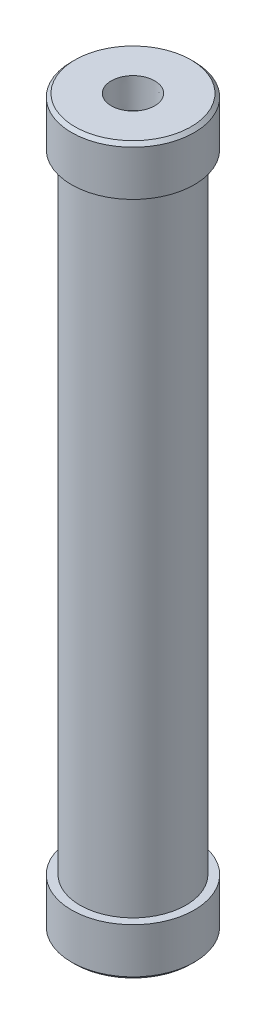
ISO-10303-21;
HEADER;
FILE_DESCRIPTION(('STEP AP214'),'2;1');
FILE_NAME('part.step','',(''),(''),'','','');
FILE_SCHEMA(('AUTOMOTIVE_DESIGN { 1 0 10303 214 1 1 1 1 }'));
ENDSEC;
DATA;
#1=APPLICATION_CONTEXT('core data for automotive mechanical design processes');
#2=APPLICATION_PROTOCOL_DEFINITION('international standard','automotive_design',2000,#1);
#3=PRODUCT_CONTEXT('',#1,'mechanical');
#4=PRODUCT('Part','Part','',(#3));
#5=PRODUCT_RELATED_PRODUCT_CATEGORY('part','',(#4));
#6=PRODUCT_DEFINITION_FORMATION('','',#4);
#7=PRODUCT_DEFINITION_CONTEXT('part definition',#1,'design');
#8=PRODUCT_DEFINITION('design','',#6,#7);
#9=PRODUCT_DEFINITION_SHAPE('','',#8);
#10=(LENGTH_UNIT() NAMED_UNIT(*) SI_UNIT(.MILLI.,.METRE.));
#11=(NAMED_UNIT(*) PLANE_ANGLE_UNIT() SI_UNIT($,.RADIAN.));
#12=(NAMED_UNIT(*) SI_UNIT($,.STERADIAN.) SOLID_ANGLE_UNIT());
#13=UNCERTAINTY_MEASURE_WITH_UNIT(LENGTH_MEASURE(1.E-05),#10,'distance_accuracy_value','');
#14=(GEOMETRIC_REPRESENTATION_CONTEXT(3) GLOBAL_UNCERTAINTY_ASSIGNED_CONTEXT((#13)) GLOBAL_UNIT_ASSIGNED_CONTEXT((#10,
#11,#12)) REPRESENTATION_CONTEXT('',''));
#15=CARTESIAN_POINT('',(0.,0.,0.));
#16=DIRECTION('',(0.,0.,1.));
#17=DIRECTION('',(1.,0.,0.));
#18=AXIS2_PLACEMENT_3D('',#15,#16,#17);
#19=CARTESIAN_POINT('',(0.,22.098,0.));
#20=DIRECTION('',(0.,1.,0.));
#21=DIRECTION('',(0.,0.,1.));
#22=AXIS2_PLACEMENT_3D('',#19,#20,#21);
#23=PLANE('',#22);
#24=CARTESIAN_POINT('',(0.,22.098,0.));
#25=DIRECTION('',(0.,1.,0.));
#26=DIRECTION('',(0.,0.,1.));
#27=AXIS2_PLACEMENT_3D('',#24,#25,#26);
#28=CIRCLE('',#27,8.92810000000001);
#29=CARTESIAN_POINT('',(0.,22.098,8.92810000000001));
#30=VERTEX_POINT('',#29);
#31=EDGE_CURVE('E54',#30,#30,#28,.T.);
#32=ORIENTED_EDGE('',*,*,#31,.F.);
#33=EDGE_LOOP('',(#32));
#34=FACE_BOUND('',#33,.T.);
#35=CARTESIAN_POINT('',(0.,22.098,0.));
#36=DIRECTION('',(0.,1.,0.));
#37=DIRECTION('',(0.,0.,1.));
#38=AXIS2_PLACEMENT_3D('',#35,#36,#37);
#39=CIRCLE('',#38,20.32);
#40=CARTESIAN_POINT('',(0.,22.098,20.32));
#41=VERTEX_POINT('',#40);
#42=EDGE_CURVE('E68',#41,#41,#39,.T.);
#43=ORIENTED_EDGE('',*,*,#42,.T.);
#44=EDGE_LOOP('',(#43));
#45=FACE_BOUND('',#44,.T.);
#46=ADVANCED_FACE('F33',(#34,#45),#23,.T.);
#47=CARTESIAN_POINT('',(0.,330.2,0.));
#48=DIRECTION('',(0.,-1.,0.));
#49=DIRECTION('',(0.,0.,-1.));
#50=AXIS2_PLACEMENT_3D('',#47,#48,#49);
#51=CYLINDRICAL_SURFACE('',#50,20.32);
#52=ORIENTED_EDGE('',*,*,#42,.F.);
#53=EDGE_LOOP('',(#52));
#54=FACE_BOUND('',#53,.T.);
#55=CARTESIAN_POINT('',(0.,308.102,0.));
#56=DIRECTION('',(0.,1.,0.));
#57=DIRECTION('',(0.,0.,1.));
#58=AXIS2_PLACEMENT_3D('',#55,#56,#57);
#59=CIRCLE('',#58,20.32);
#60=CARTESIAN_POINT('',(0.,308.102,20.32));
#61=VERTEX_POINT('',#60);
#62=EDGE_CURVE('E64',#61,#61,#59,.T.);
#63=ORIENTED_EDGE('',*,*,#62,.T.);
#64=EDGE_LOOP('',(#63));
#65=FACE_BOUND('',#64,.T.);
#66=ADVANCED_FACE('F118',(#54,#65),#51,.F.);
#67=CARTESIAN_POINT('',(0.,308.102,0.));
#68=DIRECTION('',(0.,1.,0.));
#69=DIRECTION('',(0.,0.,1.));
#70=AXIS2_PLACEMENT_3D('',#67,#68,#69);
#71=PLANE('',#70);
#72=CARTESIAN_POINT('',(0.,308.102,0.));
#73=DIRECTION('',(0.,1.,0.));
#74=DIRECTION('',(0.,0.,1.));
#75=AXIS2_PLACEMENT_3D('',#72,#73,#74);
#76=CIRCLE('',#75,8.9281);
#77=CARTESIAN_POINT('',(0.,308.102,8.9281));
#78=VERTEX_POINT('',#77);
#79=EDGE_CURVE('E59',#78,#78,#76,.T.);
#80=ORIENTED_EDGE('',*,*,#79,.T.);
#81=EDGE_LOOP('',(#80));
#82=FACE_BOUND('',#81,.T.);
#83=ORIENTED_EDGE('',*,*,#62,.F.);
#84=EDGE_LOOP('',(#83));
#85=FACE_BOUND('',#84,.T.);
#86=ADVANCED_FACE('F111',(#82,#85),#71,.F.);
#87=CARTESIAN_POINT('',(0.,330.2,0.));
#88=DIRECTION('',(0.,1.,0.));
#89=DIRECTION('',(0.,0.,1.));
#90=AXIS2_PLACEMENT_3D('',#87,#88,#89);
#91=CYLINDRICAL_SURFACE('',#90,8.9281);
#92=CARTESIAN_POINT('',(0.,316.738,0.));
#93=DIRECTION('',(0.,1.,0.));
#94=DIRECTION('',(0.,0.,1.));
#95=AXIS2_PLACEMENT_3D('',#92,#93,#94);
#96=CIRCLE('',#95,8.9281);
#97=CARTESIAN_POINT('',(0.,316.738,8.9281));
#98=VERTEX_POINT('',#97);
#99=EDGE_CURVE('E63',#98,#98,#96,.T.);
#100=ORIENTED_EDGE('',*,*,#99,.T.);
#101=EDGE_LOOP('',(#100));
#102=FACE_BOUND('',#101,.T.);
#103=ORIENTED_EDGE('',*,*,#79,.F.);
#104=EDGE_LOOP('',(#103));
#105=FACE_BOUND('',#104,.T.);
#106=ADVANCED_FACE('F178',(#102,#105),#91,.F.);
#107=CARTESIAN_POINT('',(8.9281,316.738,0.));
#108=DIRECTION('',(0.,-1.,0.));
#109=DIRECTION('',(0.,0.,-1.));
#110=AXIS2_PLACEMENT_3D('',#107,#108,#109);
#111=PLANE('',#110);
#112=ORIENTED_EDGE('',*,*,#99,.F.);
#113=EDGE_LOOP('',(#112));
#114=FACE_BOUND('',#113,.T.);
#115=CARTESIAN_POINT('',(0.,316.738,0.));
#116=DIRECTION('',(0.,1.,0.));
#117=DIRECTION('',(0.,0.,1.));
#118=AXIS2_PLACEMENT_3D('',#115,#116,#117);
#119=CIRCLE('',#118,9.47972679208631);
#120=CARTESIAN_POINT('',(0.,316.738,9.47972679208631));
#121=VERTEX_POINT('',#120);
#122=EDGE_CURVE('E82',#121,#121,#119,.T.);
#123=ORIENTED_EDGE('',*,*,#122,.T.);
#124=EDGE_LOOP('',(#123));
#125=FACE_BOUND('',#124,.T.);
#126=ADVANCED_FACE('F147',(#114,#125),#111,.F.);
#127=CARTESIAN_POINT('',(0.,330.2,0.));
#128=DIRECTION('',(0.,1.,0.));
#129=DIRECTION('',(0.,0.,1.));
#130=AXIS2_PLACEMENT_3D('',#127,#128,#129);
#131=CONICAL_SURFACE('',#130,9.8827971,0.0299323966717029);
#132=ORIENTED_EDGE('',*,*,#122,.F.);
#133=EDGE_LOOP('',(#132));
#134=FACE_BOUND('',#133,.T.);
#135=CARTESIAN_POINT('',(0.,330.2,0.));
#136=DIRECTION('',(0.,1.,0.));
#137=DIRECTION('',(0.,0.,1.));
#138=AXIS2_PLACEMENT_3D('',#135,#136,#137);
#139=CIRCLE('',#138,9.8827971);
#140=CARTESIAN_POINT('',(0.,330.2,9.8827971));
#141=VERTEX_POINT('',#140);
#142=EDGE_CURVE('E57',#141,#141,#139,.T.);
#143=ORIENTED_EDGE('',*,*,#142,.T.);
#144=EDGE_LOOP('',(#143));
#145=FACE_BOUND('',#144,.T.);
#146=ADVANCED_FACE('F135',(#134,#145),#131,.F.);
#147=CARTESIAN_POINT('',(0.,330.2,0.));
#148=DIRECTION('',(0.,-1.,0.));
#149=DIRECTION('',(0.,0.,-1.));
#150=AXIS2_PLACEMENT_3D('',#147,#148,#149);
#151=CYLINDRICAL_SURFACE('',#150,24.13);
#152=CARTESIAN_POINT('',(0.,22.098,0.));
#153=DIRECTION('',(0.,1.,0.));
#154=DIRECTION('',(0.,0.,1.));
#155=AXIS2_PLACEMENT_3D('',#152,#153,#154);
#156=CIRCLE('',#155,24.13);
#157=CARTESIAN_POINT('',(0.,22.098,24.13));
#158=VERTEX_POINT('',#157);
#159=EDGE_CURVE('E71',#158,#158,#156,.T.);
#160=ORIENTED_EDGE('',*,*,#159,.T.);
#161=EDGE_LOOP('',(#160));
#162=FACE_BOUND('',#161,.T.);
#163=CARTESIAN_POINT('',(0.,308.102,0.));
#164=DIRECTION('',(0.,1.,0.));
#165=DIRECTION('',(0.,0.,1.));
#166=AXIS2_PLACEMENT_3D('',#163,#164,#165);
#167=CIRCLE('',#166,24.13);
#168=CARTESIAN_POINT('',(0.,308.102,24.13));
#169=VERTEX_POINT('',#168);
#170=EDGE_CURVE('E53',#169,#169,#167,.T.);
#171=ORIENTED_EDGE('',*,*,#170,.F.);
#172=EDGE_LOOP('',(#171));
#173=FACE_BOUND('',#172,.T.);
#174=ADVANCED_FACE('F130',(#162,#173),#151,.T.);
#175=CARTESIAN_POINT('',(0.,22.098,0.));
#176=DIRECTION('',(0.,1.,0.));
#177=DIRECTION('',(0.,0.,1.));
#178=AXIS2_PLACEMENT_3D('',#175,#176,#177);
#179=CIRCLE('',#178,27.94);
#180=CARTESIAN_POINT('',(0.,22.098,27.94));
#181=VERTEX_POINT('',#180);
#182=EDGE_CURVE('E67',#181,#181,#179,.T.);
#183=ORIENTED_EDGE('',*,*,#182,.T.);
#184=EDGE_LOOP('',(#183));
#185=FACE_BOUND('',#184,.T.);
#186=ORIENTED_EDGE('',*,*,#159,.F.);
#187=EDGE_LOOP('',(#186));
#188=FACE_BOUND('',#187,.T.);
#189=ADVANCED_FACE('F112',(#185,#188),#23,.T.);
#190=CARTESIAN_POINT('',(0.,22.098,0.));
#191=DIRECTION('',(0.,-1.,0.));
#192=DIRECTION('',(0.,0.,-1.));
#193=AXIS2_PLACEMENT_3D('',#190,#191,#192);
#194=CYLINDRICAL_SURFACE('',#193,27.94);
#195=CARTESIAN_POINT('',(0.,1.52400000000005,0.));
#196=DIRECTION('',(0.,1.,0.));
#197=DIRECTION('',(0.,0.,1.));
#198=AXIS2_PLACEMENT_3D('',#195,#196,#197);
#199=CIRCLE('',#198,27.94);
#200=CARTESIAN_POINT('',(0.,1.52400000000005,27.94));
#201=VERTEX_POINT('',#200);
#202=EDGE_CURVE('E48',#201,#201,#199,.T.);
#203=ORIENTED_EDGE('',*,*,#202,.T.);
#204=EDGE_LOOP('',(#203));
#205=FACE_BOUND('',#204,.T.);
#206=ORIENTED_EDGE('',*,*,#182,.F.);
#207=EDGE_LOOP('',(#206));
#208=FACE_BOUND('',#207,.T.);
#209=ADVANCED_FACE('F101',(#205,#208),#194,.T.);
#210=CARTESIAN_POINT('',(0.,0.,0.));
#211=DIRECTION('',(0.,1.,0.));
#212=DIRECTION('',(0.,0.,1.));
#213=AXIS2_PLACEMENT_3D('',#210,#211,#212);
#214=PLANE('',#213);
#215=CARTESIAN_POINT('',(0.,0.,0.));
#216=DIRECTION('',(0.,1.,0.));
#217=DIRECTION('',(0.,0.,1.));
#218=AXIS2_PLACEMENT_3D('',#215,#216,#217);
#219=CIRCLE('',#218,26.416);
#220=CARTESIAN_POINT('',(0.,0.,26.416));
#221=VERTEX_POINT('',#220);
#222=EDGE_CURVE('E44',#221,#221,#219,.F.);
#223=ORIENTED_EDGE('',*,*,#222,.T.);
#224=EDGE_LOOP('',(#223));
#225=FACE_BOUND('',#224,.T.);
#226=CARTESIAN_POINT('',(0.,0.,0.));
#227=DIRECTION('',(0.,-1.,0.));
#228=DIRECTION('',(0.,0.,-1.));
#229=AXIS2_PLACEMENT_3D('',#226,#227,#228);
#230=CIRCLE('',#229,9.8827971);
#231=CARTESIAN_POINT('',(0.,0.,-9.8827971));
#232=VERTEX_POINT('',#231);
#233=EDGE_CURVE('E92',#232,#232,#230,.T.);
#234=ORIENTED_EDGE('',*,*,#233,.F.);
#235=EDGE_LOOP('',(#234));
#236=FACE_BOUND('',#235,.T.);
#237=ADVANCED_FACE('F98',(#225,#236),#214,.F.);
#238=CARTESIAN_POINT('',(0.,308.102,0.));
#239=DIRECTION('',(0.,1.,0.));
#240=DIRECTION('',(0.,0.,1.));
#241=AXIS2_PLACEMENT_3D('',#238,#239,#240);
#242=CIRCLE('',#241,27.94);
#243=CARTESIAN_POINT('',(0.,308.102,27.94));
#244=VERTEX_POINT('',#243);
#245=EDGE_CURVE('E62',#244,#244,#242,.T.);
#246=ORIENTED_EDGE('',*,*,#245,.F.);
#247=EDGE_LOOP('',(#246));
#248=FACE_BOUND('',#247,.T.);
#249=ORIENTED_EDGE('',*,*,#170,.T.);
#250=EDGE_LOOP('',(#249));
#251=FACE_BOUND('',#250,.T.);
#252=ADVANCED_FACE('F100',(#248,#251),#71,.F.);
#253=CARTESIAN_POINT('',(0.,308.102,0.));
#254=DIRECTION('',(0.,1.,0.));
#255=DIRECTION('',(0.,0.,1.));
#256=AXIS2_PLACEMENT_3D('',#253,#254,#255);
#257=CYLINDRICAL_SURFACE('',#256,27.94);
#258=CARTESIAN_POINT('',(0.,328.676,0.));
#259=DIRECTION('',(0.,1.,0.));
#260=DIRECTION('',(0.,0.,1.));
#261=AXIS2_PLACEMENT_3D('',#258,#259,#260);
#262=CIRCLE('',#261,27.94);
#263=CARTESIAN_POINT('',(0.,328.676,-27.94));
#264=VERTEX_POINT('',#263);
#265=EDGE_CURVE('E10',#264,#264,#262,.F.);
#266=ORIENTED_EDGE('',*,*,#265,.T.);
#267=EDGE_LOOP('',(#266));
#268=FACE_BOUND('',#267,.T.);
#269=ORIENTED_EDGE('',*,*,#245,.T.);
#270=EDGE_LOOP('',(#269));
#271=FACE_BOUND('',#270,.T.);
#272=ADVANCED_FACE('F108',(#268,#271),#257,.T.);
#273=CARTESIAN_POINT('',(0.,330.2,0.));
#274=DIRECTION('',(0.,1.,0.));
#275=DIRECTION('',(0.,0.,1.));
#276=AXIS2_PLACEMENT_3D('',#273,#274,#275);
#277=PLANE('',#276);
#278=CARTESIAN_POINT('',(0.,330.2,0.));
#279=DIRECTION('',(0.,1.,0.));
#280=DIRECTION('',(0.,0.,1.));
#281=AXIS2_PLACEMENT_3D('',#278,#279,#280);
#282=CIRCLE('',#281,26.4159999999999);
#283=CARTESIAN_POINT('',(0.,330.2,-26.416));
#284=VERTEX_POINT('',#283);
#285=EDGE_CURVE('E40',#284,#284,#282,.T.);
#286=ORIENTED_EDGE('',*,*,#285,.T.);
#287=EDGE_LOOP('',(#286));
#288=FACE_BOUND('',#287,.T.);
#289=ORIENTED_EDGE('',*,*,#142,.F.);
#290=EDGE_LOOP('',(#289));
#291=FACE_BOUND('',#290,.T.);
#292=ADVANCED_FACE('F173',(#288,#291),#277,.T.);
#293=CARTESIAN_POINT('',(0.,0.,0.));
#294=DIRECTION('',(0.,-1.,0.));
#295=DIRECTION('',(0.,0.,-1.));
#296=AXIS2_PLACEMENT_3D('',#293,#294,#295);
#297=CYLINDRICAL_SURFACE('',#296,8.92810000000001);
#298=ORIENTED_EDGE('',*,*,#31,.T.);
#299=EDGE_LOOP('',(#298));
#300=FACE_BOUND('',#299,.T.);
#301=CARTESIAN_POINT('',(0.,13.462,0.));
#302=DIRECTION('',(0.,-1.,0.));
#303=DIRECTION('',(0.,0.,-1.));
#304=AXIS2_PLACEMENT_3D('',#301,#302,#303);
#305=CIRCLE('',#304,8.92810000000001);
#306=CARTESIAN_POINT('',(0.,13.462,-8.92810000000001));
#307=VERTEX_POINT('',#306);
#308=EDGE_CURVE('E58',#307,#307,#305,.T.);
#309=ORIENTED_EDGE('',*,*,#308,.T.);
#310=EDGE_LOOP('',(#309));
#311=FACE_BOUND('',#310,.T.);
#312=ADVANCED_FACE('F167',(#300,#311),#297,.F.);
#313=CARTESIAN_POINT('',(8.92810000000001,13.462,0.));
#314=DIRECTION('',(0.,1.,0.));
#315=DIRECTION('',(0.,0.,1.));
#316=AXIS2_PLACEMENT_3D('',#313,#314,#315);
#317=PLANE('',#316);
#318=ORIENTED_EDGE('',*,*,#308,.F.);
#319=EDGE_LOOP('',(#318));
#320=FACE_BOUND('',#319,.T.);
#321=CARTESIAN_POINT('',(0.,13.462,0.));
#322=DIRECTION('',(0.,-1.,0.));
#323=DIRECTION('',(0.,0.,-1.));
#324=AXIS2_PLACEMENT_3D('',#321,#322,#323);
#325=CIRCLE('',#324,9.47972679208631);
#326=CARTESIAN_POINT('',(0.,13.462,-9.47972679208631));
#327=VERTEX_POINT('',#326);
#328=EDGE_CURVE('E89',#327,#327,#325,.T.);
#329=ORIENTED_EDGE('',*,*,#328,.T.);
#330=EDGE_LOOP('',(#329));
#331=FACE_BOUND('',#330,.T.);
#332=ADVANCED_FACE('F158',(#320,#331),#317,.F.);
#333=CARTESIAN_POINT('',(0.,0.,0.));
#334=DIRECTION('',(0.,-1.,0.));
#335=DIRECTION('',(0.,0.,-1.));
#336=AXIS2_PLACEMENT_3D('',#333,#334,#335);
#337=CONICAL_SURFACE('',#336,9.8827971,0.0299323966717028);
#338=ORIENTED_EDGE('',*,*,#328,.F.);
#339=EDGE_LOOP('',(#338));
#340=FACE_BOUND('',#339,.T.);
#341=ORIENTED_EDGE('',*,*,#233,.T.);
#342=EDGE_LOOP('',(#341));
#343=FACE_BOUND('',#342,.T.);
#344=ADVANCED_FACE('F96',(#340,#343),#337,.F.);
#345=CARTESIAN_POINT('',(0.,1.52400000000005,0.));
#346=DIRECTION('',(0.,1.,0.));
#347=DIRECTION('',(0.,0.,1.));
#348=AXIS2_PLACEMENT_3D('',#345,#346,#347);
#349=CONICAL_SURFACE('',#348,27.94,0.785398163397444);
#350=CARTESIAN_POINT('',(0.,0.,26.416));
#351=CARTESIAN_POINT('',(0.,0.0158749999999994,26.431875));
#352=CARTESIAN_POINT('',(0.,0.0317500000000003,26.44775));
#353=CARTESIAN_POINT('',(0.,0.063500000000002,26.4795));
#354=CARTESIAN_POINT('',(0.,0.0793750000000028,26.495375));
#355=CARTESIAN_POINT('',(0.,0.111125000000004,26.527125));
#356=CARTESIAN_POINT('',(0.,0.127000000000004,26.543));
#357=CARTESIAN_POINT('',(0.,0.158750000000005,26.57475));
#358=CARTESIAN_POINT('',(0.,0.174625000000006,26.590625));
#359=CARTESIAN_POINT('',(0.,0.206375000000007,26.622375));
#360=CARTESIAN_POINT('',(0.,0.222250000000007,26.63825));
#361=CARTESIAN_POINT('',(0.,0.254000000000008,26.67));
#362=CARTESIAN_POINT('',(0.,0.269875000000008,26.685875));
#363=CARTESIAN_POINT('',(0.,0.30162500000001,26.717625));
#364=CARTESIAN_POINT('',(0.,0.317500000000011,26.7335));
#365=CARTESIAN_POINT('',(0.,0.349250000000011,26.76525));
#366=CARTESIAN_POINT('',(0.,0.365125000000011,26.781125));
#367=CARTESIAN_POINT('',(0.,0.396875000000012,26.812875));
#368=CARTESIAN_POINT('',(0.,0.412750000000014,26.82875));
#369=CARTESIAN_POINT('',(0.,0.444500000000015,26.8605));
#370=CARTESIAN_POINT('',(0.,0.460375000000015,26.876375));
#371=CARTESIAN_POINT('',(0.,0.492125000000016,26.908125));
#372=CARTESIAN_POINT('',(0.,0.508000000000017,26.924));
#373=CARTESIAN_POINT('',(0.,0.539750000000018,26.95575));
#374=CARTESIAN_POINT('',(0.,0.555625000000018,26.971625));
#375=CARTESIAN_POINT('',(0.,0.587375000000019,27.003375));
#376=CARTESIAN_POINT('',(0.,0.603250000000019,27.01925));
#377=CARTESIAN_POINT('',(0.,0.63500000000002,27.051));
#378=CARTESIAN_POINT('',(0.,0.650875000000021,27.066875));
#379=CARTESIAN_POINT('',(0.,0.682625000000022,27.098625));
#380=CARTESIAN_POINT('',(0.,0.698500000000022,27.1145));
#381=CARTESIAN_POINT('',(0.,0.730250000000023,27.14625));
#382=CARTESIAN_POINT('',(0.,0.746125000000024,27.162125));
#383=CARTESIAN_POINT('',(0.,0.777875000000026,27.193875));
#384=CARTESIAN_POINT('',(0.,0.793750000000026,27.20975));
#385=CARTESIAN_POINT('',(0.,0.825500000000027,27.2415));
#386=CARTESIAN_POINT('',(0.,0.841375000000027,27.257375));
#387=CARTESIAN_POINT('',(0.,0.873125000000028,27.289125));
#388=CARTESIAN_POINT('',(0.,0.889000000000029,27.305));
#389=CARTESIAN_POINT('',(0.,0.92075000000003,27.33675));
#390=CARTESIAN_POINT('',(0.,0.93662500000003,27.352625));
#391=CARTESIAN_POINT('',(0.,0.968375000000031,27.384375));
#392=CARTESIAN_POINT('',(0.,0.984250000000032,27.40025));
#393=CARTESIAN_POINT('',(0.,1.01600000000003,27.432));
#394=CARTESIAN_POINT('',(0.,1.03187500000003,27.447875));
#395=CARTESIAN_POINT('',(0.,1.06362500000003,27.479625));
#396=CARTESIAN_POINT('',(0.,1.07950000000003,27.4955));
#397=CARTESIAN_POINT('',(0.,1.11125000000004,27.52725));
#398=CARTESIAN_POINT('',(0.,1.12712500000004,27.543125));
#399=CARTESIAN_POINT('',(0.,1.15887500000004,27.574875));
#400=CARTESIAN_POINT('',(0.,1.17475000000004,27.59075));
#401=CARTESIAN_POINT('',(0.,1.20650000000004,27.6225));
#402=CARTESIAN_POINT('',(0.,1.22237500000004,27.638375));
#403=CARTESIAN_POINT('',(0.,1.25412500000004,27.670125));
#404=CARTESIAN_POINT('',(0.,1.27000000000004,27.686));
#405=CARTESIAN_POINT('',(0.,1.30175000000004,27.71775));
#406=CARTESIAN_POINT('',(0.,1.31762500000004,27.733625));
#407=CARTESIAN_POINT('',(0.,1.34937500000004,27.765375));
#408=CARTESIAN_POINT('',(0.,1.36525000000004,27.78125));
#409=CARTESIAN_POINT('',(0.,1.39700000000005,27.813));
#410=CARTESIAN_POINT('',(0.,1.41287500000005,27.828875));
#411=CARTESIAN_POINT('',(0.,1.44462500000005,27.860625));
#412=CARTESIAN_POINT('',(0.,1.46050000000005,27.8765));
#413=CARTESIAN_POINT('',(0.,1.49225000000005,27.90825));
#414=CARTESIAN_POINT('',(0.,1.50812500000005,27.924125));
#415=CARTESIAN_POINT('',(0.,1.52400000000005,27.94));
#416=B_SPLINE_CURVE_WITH_KNOTS('',3,(#350,#351,#352,#353,#354,#355,#356,#357,#358,#359,#360,
#361,#362,#363,#364,#365,#366,#367,#368,#369,#370,#371,#372,#373,#374,#375,#376,#377,#378,#379,
#380,#381,#382,#383,#384,#385,#386,#387,#388,#389,#390,#391,#392,#393,#394,#395,#396,#397,#398,
#399,#400,#401,#402,#403,#404,#405,#406,#407,#408,#409,#410,#411,#412,#413,#414,#415),
.UNSPECIFIED.,.F.,.F.,(4,2,2,2,2,2,2,2,2,2,2,2,2,2,2,2,2,2,2,2,2,2,2,2,2,2,2,2,2,2,2,2,4),(0.,
0.0673519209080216,0.134703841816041,0.202055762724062,0.269407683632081,0.336759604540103,
0.404111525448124,0.471463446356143,0.538815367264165,0.606167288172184,0.673519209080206,
0.740871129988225,0.808223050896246,0.875574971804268,0.942926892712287,1.01027881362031,
1.07763073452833,1.14498265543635,1.21233457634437,1.27968649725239,1.34703841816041,
1.41439033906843,1.48174225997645,1.54909418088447,1.61644610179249,1.68379802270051,
1.75114994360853,1.81850186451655,1.88585378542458,1.95320570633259,2.02055762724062,
2.08790954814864,2.15526146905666),.UNSPECIFIED.);
#417=EDGE_CURVE('BSEAM150',#221,#201,#416,.T.);
#418=ORIENTED_EDGE('',*,*,#222,.F.);
#419=ORIENTED_EDGE('',*,*,#202,.F.);
#420=ORIENTED_EDGE('',*,*,#417,.T.);
#421=ORIENTED_EDGE('',*,*,#417,.F.);
#422=EDGE_LOOP('',(#418,#420,#419,#421));
#423=FACE_BOUND('',#422,.T.);
#424=ADVANCED_FACE('F150',(#423),#349,.T.);
#425=CARTESIAN_POINT('',(0.,330.2,0.));
#426=DIRECTION('',(0.,-1.,0.));
#427=DIRECTION('',(0.,0.,-1.));
#428=AXIS2_PLACEMENT_3D('',#425,#426,#427);
#429=CONICAL_SURFACE('',#428,26.4159999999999,0.785398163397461);
#430=CARTESIAN_POINT('',(0.,328.676,-27.94));
#431=CARTESIAN_POINT('',(0.,328.691875,-27.924125));
#432=CARTESIAN_POINT('',(0.,328.70775,-27.90825));
#433=CARTESIAN_POINT('',(0.,328.7395,-27.8765));
#434=CARTESIAN_POINT('',(0.,328.755375,-27.860625));
#435=CARTESIAN_POINT('',(0.,328.787125,-27.828875));
#436=CARTESIAN_POINT('',(0.,328.803,-27.813));
#437=CARTESIAN_POINT('',(0.,328.83475,-27.78125));
#438=CARTESIAN_POINT('',(0.,328.850625,-27.765375));
#439=CARTESIAN_POINT('',(0.,328.882375,-27.733625));
#440=CARTESIAN_POINT('',(0.,328.89825,-27.71775));
#441=CARTESIAN_POINT('',(0.,328.93,-27.686));
#442=CARTESIAN_POINT('',(0.,328.945875,-27.670125));
#443=CARTESIAN_POINT('',(0.,328.977625,-27.638375));
#444=CARTESIAN_POINT('',(0.,328.9935,-27.6225));
#445=CARTESIAN_POINT('',(0.,329.02525,-27.59075));
#446=CARTESIAN_POINT('',(0.,329.041125,-27.574875));
#447=CARTESIAN_POINT('',(0.,329.072875,-27.543125));
#448=CARTESIAN_POINT('',(0.,329.08875,-27.52725));
#449=CARTESIAN_POINT('',(0.,329.1205,-27.4955));
#450=CARTESIAN_POINT('',(0.,329.136375,-27.479625));
#451=CARTESIAN_POINT('',(0.,329.168125,-27.447875));
#452=CARTESIAN_POINT('',(0.,329.184,-27.432));
#453=CARTESIAN_POINT('',(0.,329.21575,-27.40025));
#454=CARTESIAN_POINT('',(0.,329.231625,-27.384375));
#455=CARTESIAN_POINT('',(0.,329.263375,-27.352625));
#456=CARTESIAN_POINT('',(0.,329.27925,-27.33675));
#457=CARTESIAN_POINT('',(0.,329.311,-27.305));
#458=CARTESIAN_POINT('',(0.,329.326875,-27.289125));
#459=CARTESIAN_POINT('',(0.,329.358625,-27.257375));
#460=CARTESIAN_POINT('',(0.,329.3745,-27.2415));
#461=CARTESIAN_POINT('',(0.,329.40625,-27.20975));
#462=CARTESIAN_POINT('',(0.,329.422125,-27.193875));
#463=CARTESIAN_POINT('',(0.,329.453875,-27.162125));
#464=CARTESIAN_POINT('',(0.,329.46975,-27.14625));
#465=CARTESIAN_POINT('',(0.,329.5015,-27.1145));
#466=CARTESIAN_POINT('',(0.,329.517375,-27.098625));
#467=CARTESIAN_POINT('',(0.,329.549125,-27.066875));
#468=CARTESIAN_POINT('',(0.,329.565,-27.051));
#469=CARTESIAN_POINT('',(0.,329.59675,-27.01925));
#470=CARTESIAN_POINT('',(0.,329.612625,-27.003375));
#471=CARTESIAN_POINT('',(0.,329.644375,-26.971625));
#472=CARTESIAN_POINT('',(0.,329.66025,-26.95575));
#473=CARTESIAN_POINT('',(0.,329.692,-26.924));
#474=CARTESIAN_POINT('',(0.,329.707875,-26.908125));
#475=CARTESIAN_POINT('',(0.,329.739625,-26.876375));
#476=CARTESIAN_POINT('',(0.,329.7555,-26.8605));
#477=CARTESIAN_POINT('',(0.,329.78725,-26.82875));
#478=CARTESIAN_POINT('',(0.,329.803125,-26.812875));
#479=CARTESIAN_POINT('',(0.,329.834875,-26.781125));
#480=CARTESIAN_POINT('',(0.,329.85075,-26.76525));
#481=CARTESIAN_POINT('',(0.,329.8825,-26.7335));
#482=CARTESIAN_POINT('',(0.,329.898375,-26.717625));
#483=CARTESIAN_POINT('',(0.,329.930125,-26.685875));
#484=CARTESIAN_POINT('',(0.,329.946,-26.67));
#485=CARTESIAN_POINT('',(0.,329.97775,-26.63825));
#486=CARTESIAN_POINT('',(0.,329.993625,-26.622375));
#487=CARTESIAN_POINT('',(0.,330.025375,-26.590625));
#488=CARTESIAN_POINT('',(0.,330.04125,-26.57475));
#489=CARTESIAN_POINT('',(0.,330.073,-26.543));
#490=CARTESIAN_POINT('',(0.,330.088875,-26.527125));
#491=CARTESIAN_POINT('',(0.,330.120625,-26.495375));
#492=CARTESIAN_POINT('',(0.,330.1365,-26.4795));
#493=CARTESIAN_POINT('',(0.,330.16825,-26.44775));
#494=CARTESIAN_POINT('',(0.,330.184125,-26.431875));
#495=CARTESIAN_POINT('',(0.,330.2,-26.416));
#496=B_SPLINE_CURVE_WITH_KNOTS('',3,(#430,#431,#432,#433,#434,#435,#436,#437,#438,#439,#440,
#441,#442,#443,#444,#445,#446,#447,#448,#449,#450,#451,#452,#453,#454,#455,#456,#457,#458,#459,
#460,#461,#462,#463,#464,#465,#466,#467,#468,#469,#470,#471,#472,#473,#474,#475,#476,#477,#478,
#479,#480,#481,#482,#483,#484,#485,#486,#487,#488,#489,#490,#491,#492,#493,#494,#495),
.UNSPECIFIED.,.F.,.F.,(4,2,2,2,2,2,2,2,2,2,2,2,2,2,2,2,2,2,2,2,2,2,2,2,2,2,2,2,2,2,2,2,4),(0.,
0.0673519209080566,0.134703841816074,0.202055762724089,0.269407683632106,0.336759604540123,
0.404111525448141,0.471463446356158,0.538815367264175,0.606167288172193,0.673519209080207,
0.740871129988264,0.808223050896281,0.875574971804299,0.942926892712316,1.01027881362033,
1.07763073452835,1.14498265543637,1.21233457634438,1.2796864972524,1.34703841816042,
1.41439033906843,1.48174225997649,1.54909418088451,1.61644610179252,1.68379802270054,
1.75114994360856,1.81850186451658,1.88585378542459,1.95320570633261,2.02055762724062,
2.08790954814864,2.1552614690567),.UNSPECIFIED.);
#497=EDGE_CURVE('BSEAM35',#264,#284,#496,.T.);
#498=ORIENTED_EDGE('',*,*,#265,.F.);
#499=ORIENTED_EDGE('',*,*,#285,.F.);
#500=ORIENTED_EDGE('',*,*,#497,.T.);
#501=ORIENTED_EDGE('',*,*,#497,.F.);
#502=EDGE_LOOP('',(#498,#500,#499,#501));
#503=FACE_BOUND('',#502,.T.);
#504=ADVANCED_FACE('F35',(#503),#429,.T.);
#505=CLOSED_SHELL('',(#46,#66,#86,#106,#126,#146,#174,#189,#209,#237,#252,#272,#292,#312,#332,
#344,#424,#504));
#506=MANIFOLD_SOLID_BREP('B2',#505);
#507=ADVANCED_BREP_SHAPE_REPRESENTATION('',(#18,#506),#14);
#508=SHAPE_DEFINITION_REPRESENTATION(#9,#507);
ENDSEC;
END-ISO-10303-21;
